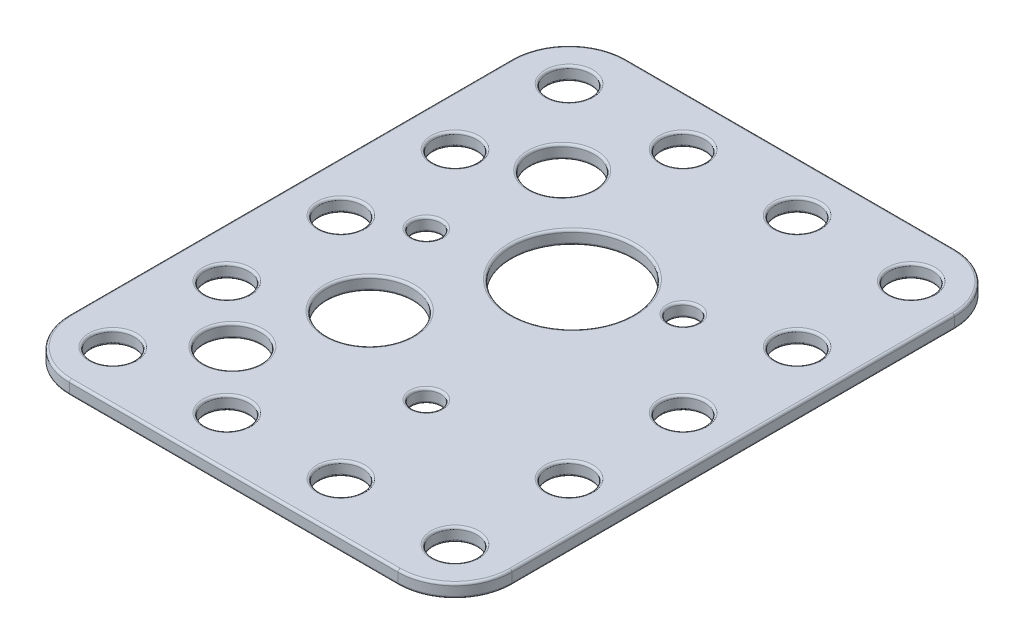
from build123d import *

# Parameters (mm, degrees)
SKETCH1_R          = 3.5687
SKETCH1_R_2        = 4.7625
SKETCH1_R_3        = 3.175
SKETCH1_R_4        = 6.7564
EXTRUDE1_DEPTH     = 1.524
SKETCH2_R          = 2.413
CUT_EXTRUDE1_DEPTH = 80.192621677
LPATTERN1_COUNT    = 4
LPATTERN1_PITCH    = 12.7
LPATTERN2_COUNT    = 5
LPATTERN2_PITCH    = 12.7
SKETCH3_R          = 2.413
CUT_EXTRUDE2_DEPTH = 80.192621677
LPATTERN3_COUNT    = 4
LPATTERN3_PITCH    = 12.7
LPATTERN4_COUNT    = 3
LPATTERN4_PITCH    = 12.7
SKETCH5_R          = 1.5875
CUT_EXTRUDE3_DEPTH = 80.192621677
FILLET1_R          = 0.254


with BuildPart() as part:
    # Sketch1 → Extrude1 (new body)
    with BuildSketch(Plane(origin=(0, 0, 0), x_dir=(1, 0, 0), z_dir=(0, 1, 0))):
        with BuildLine():
            Line((6.35, 0), (42.926, 0))
            ThreePointArc((42.926, 0), (47.416128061, 1.859871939), (49.276, 6.35))
            Line((49.276, 6.35), (49.276, 55.626))
            ThreePointArc((49.276, 55.626), (47.416128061, 60.116128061), (42.926, 61.976))
            Line((42.926, 61.976), (6.35, 61.976))
            ThreePointArc((6.35, 61.976), (1.859871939, 60.116128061), (0, 55.626))
            Line((0, 55.626), (0, 6.35))
            ThreePointArc((0, 6.35), (1.859871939, 1.859871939), (6.35, 0))
        make_face()
        with Locations(Location((13.5636, 47.6504, 0), (0, 0, 90))):
            Circle(SKETCH1_R, mode=Mode.SUBTRACT)
        with Locations(Location((16.383, 23.3934, 0), (0, 0, 90))):
            Circle(SKETCH1_R_2, mode=Mode.SUBTRACT)
        with Locations(Location((12.192, 12.2936, 0), (0, 0, 90))):
            Circle(SKETCH1_R_3, mode=Mode.SUBTRACT)
        with Locations(Location((24.638, 37.719, 0), (0, 0, 90))):
            Circle(SKETCH1_R_4, mode=Mode.SUBTRACT)
    extrude(amount=EXTRUDE1_DEPTH)

    # Sketch2 → Cut-Extrude1 (cut, through all)
    with BuildSketch(Plane(origin=(0, 1.524, 0), x_dir=(-1, 0, 0), z_dir=(0, 1, 0))):
        with Locations(Location((-5.588, -56.388, 0), (0, 0, 90))):
            Circle(SKETCH2_R)
    cut_extrude1 = extrude(amount=-CUT_EXTRUDE1_DEPTH, mode=Mode.SUBTRACT)

    # LPattern1: Cut-Extrude1 ×4
    with Locations(*[(i * LPATTERN1_PITCH, 0, 0) for i in range(1, LPATTERN1_COUNT)]):
        add(cut_extrude1, mode=Mode.SUBTRACT)

    # LPattern2: Cut-Extrude1 ×5
    with Locations(*[(0, 0, i * LPATTERN2_PITCH) for i in range(1, LPATTERN2_COUNT)]):
        add(cut_extrude1, mode=Mode.SUBTRACT)

    # Sketch3 → Cut-Extrude2 (cut, through all)
    with BuildSketch(Plane(origin=(0, 1.524, 0), x_dir=(-1, 0, 0), z_dir=(0, 1, 0))):
        with Locations(Location((-43.688, -5.588, 0), (0, 0, 90))):
            Circle(SKETCH3_R)
    cut_extrude2 = extrude(amount=-CUT_EXTRUDE2_DEPTH, mode=Mode.SUBTRACT)

    # LPattern3: Cut-Extrude2 ×4
    with Locations(*[(0, 0, -i * LPATTERN3_PITCH) for i in range(1, LPATTERN3_COUNT)]):
        add(cut_extrude2, mode=Mode.SUBTRACT)

    # LPattern4: Cut-Extrude2 ×3
    with Locations(*[(-i * LPATTERN4_PITCH, 0, 0) for i in range(1, LPATTERN4_COUNT)]):
        add(cut_extrude2, mode=Mode.SUBTRACT)

    # Sketch5 → Cut-Extrude3 (cut, through all)
    with BuildSketch(Plane(origin=(0, 1.524, 0), x_dir=(-1, 0, 0), z_dir=(0, 1, 0))):
        with Locations(Location((-28.128795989, -17.960172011, 0), (0, 0, 90))):
            Circle(SKETCH5_R)
        with Locations(Location((-34.175032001, -40.525032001, 0), (0, 0, 90))):
            Circle(SKETCH5_R)
        with Locations(Location((-11.610172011, -34.478795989, 0), (0, 0, 90))):
            Circle(SKETCH5_R)
    extrude(amount=-CUT_EXTRUDE3_DEPTH, mode=Mode.SUBTRACT)

    # Fillet1
    fillet1_edges = [part.edges().sort_by_distance(p)[0] for p in [
        (1.859871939, 1.524, -1.859871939),
        (34.175032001, 0, -42.112532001),
        (34.175032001, 1.524, -42.112532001),
        (11.610172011, 0, -36.066295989),
        (11.610172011, 1.524, -36.066295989),
        (24.638, 1.524, 0),
        (47.416128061, 1.524, -1.859871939),
        (49.276, 1.524, -30.988),
        (13.5636, 0, -44.0817),
        (13.5636, 1.524, -44.0817),
        (47.416128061, 1.524, -60.116128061),
        (16.383, 0, -18.6309),
        (16.383, 1.524, -18.6309),
        (24.638, 1.524, -61.976),
        (12.192, 0, -9.1186),
        (12.192, 1.524, -9.1186),
        (24.638, 0, -30.9626),
        (24.638, 1.524, -30.9626),
        (1.859871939, 1.524, -60.116128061),
        (5.588, 0, -58.801),
        (5.588, 1.524, -58.801),
        (18.288, 0, -58.801),
        (18.288, 1.524, -58.801),
        (30.988, 0, -58.801),
        (30.988, 1.524, -58.801),
        (43.688, 0, -58.801),
        (43.688, 1.524, -58.801),
        (5.588, 0, -46.101),
        (5.588, 1.524, -46.101),
        (5.588, 0, -33.401),
        (5.588, 1.524, -33.401),
        (5.588, 0, -20.701),
        (5.588, 1.524, -20.701),
        (24.638, 0, -61.976),
        (5.588, 0, -8.001),
        (5.588, 1.524, -8.001),
        (0, 1.524, -30.988),
        (47.416128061, 0, -60.116128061),
        (43.688, 0, -8.001),
        (43.688, 1.524, -8.001),
        (49.276, 0, -30.988),
        (43.688, 1.524, -20.701),
        (43.688, 0, -20.701),
        (47.416128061, 0, -1.859871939),
        (43.688, 0, -33.401),
        (43.688, 1.524, -33.401),
        (43.688, 0, -46.101),
        (43.688, 1.524, -46.101),
        (24.638, 0, 0),
        (30.988, 1.524, -8.001),
        (30.988, 0, -8.001),
        (1.859871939, 0, -1.859871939),
        (18.288, 0, -8.001),
        (18.288, 1.524, -8.001),
        (0, 0, -30.988),
        (28.128795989, 0, -19.547672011),
        (28.128795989, 1.524, -19.547672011),
        (1.859871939, 0, -60.116128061),
    ]]
    fillet(fillet1_edges, radius=FILLET1_R)


solid = part.part
